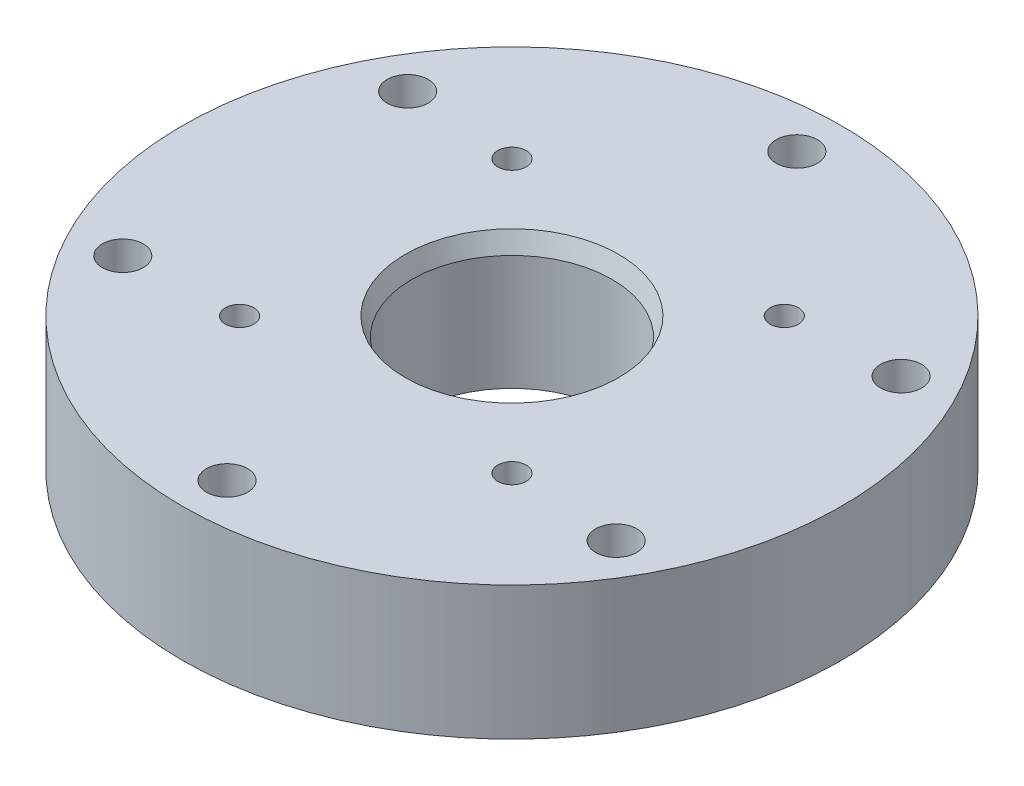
from build123d import *

# Parameters (mm, degrees)
SKETCH6_R            = 1.9558
CUT_EXTRUDE1_DEPTH   = 47.122954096
CIRPATTERN2_COUNT    = 6
LPATTERN3_COUNT      = 2
LPATTERN3_PITCH      = 25.908
LPATTERN3_COUNT_DIR2 = 2
LPATTERN3_PITCH_DIR2 = 25.908


with BuildPart() as part:
    # Sketch2 → Base-Revolve (revolve)
    with BuildSketch(Plane.XY, mode=Mode.PRIVATE) as base_revolve_sk:
        Polygon((9.525, 0), (9.525, 10.955351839), (10.16, 12.7), (31.353125, 12.7), (31.353125, 0), align=None)
    revolve(base_revolve_sk.sketch.rotate(Axis((0, 61.012371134, 0), (0, -1, 0)), 90), axis=Axis((0, 61.012371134, 0), (0, -1, 0)))

    # Sketch6 → Cut-Extrude1 (cut, through all)
    with BuildSketch(Plane(origin=(0, 12.7, 0), x_dir=(-1, 0, 0), z_dir=(0, 1, 0))):
        with Locations(Location((23.470847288, 13.5509, 0), (0, 0, 90))):
            Circle(SKETCH6_R)
    cut_extrude1 = extrude(amount=-CUT_EXTRUDE1_DEPTH, mode=Mode.SUBTRACT)

    # CirPattern2: Cut-Extrude1 ×6 about axis
    cirpattern2_axis = Axis((0, 0, 0), (0, 1, 0))
    for i in range(1, CIRPATTERN2_COUNT):
        add(cut_extrude1.rotate(cirpattern2_axis, i * 360 / CIRPATTERN2_COUNT), mode=Mode.SUBTRACT)

    # Sketch7 → 6-32 Tapped Hole2 (revolve, cut)
    with BuildSketch(Plane(origin=(-12.954, 12.7, 12.954), x_dir=(0, 0, 1), z_dir=(1, 0, 0))):
        Polygon((0, 0), (0, 10.337693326), (1.352548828, 9.525), (1.352548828, 0.002539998), (1.352548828, 0), align=None)
    f_6_32_tapped_hole2 = revolve(axis=Axis((-12.954, 19.05, 12.954), (0, -1, 0)), mode=Mode.SUBTRACT)

    # LPattern3: 6-32 Tapped Hole2 2 × 2
    with Locations(*[(i * LPATTERN3_PITCH, 0, -j * LPATTERN3_PITCH_DIR2) for i in range(LPATTERN3_COUNT) for j in range(LPATTERN3_COUNT_DIR2) if (i, j) != (0, 0)]):
        add(f_6_32_tapped_hole2, mode=Mode.SUBTRACT)


solid = part.part
